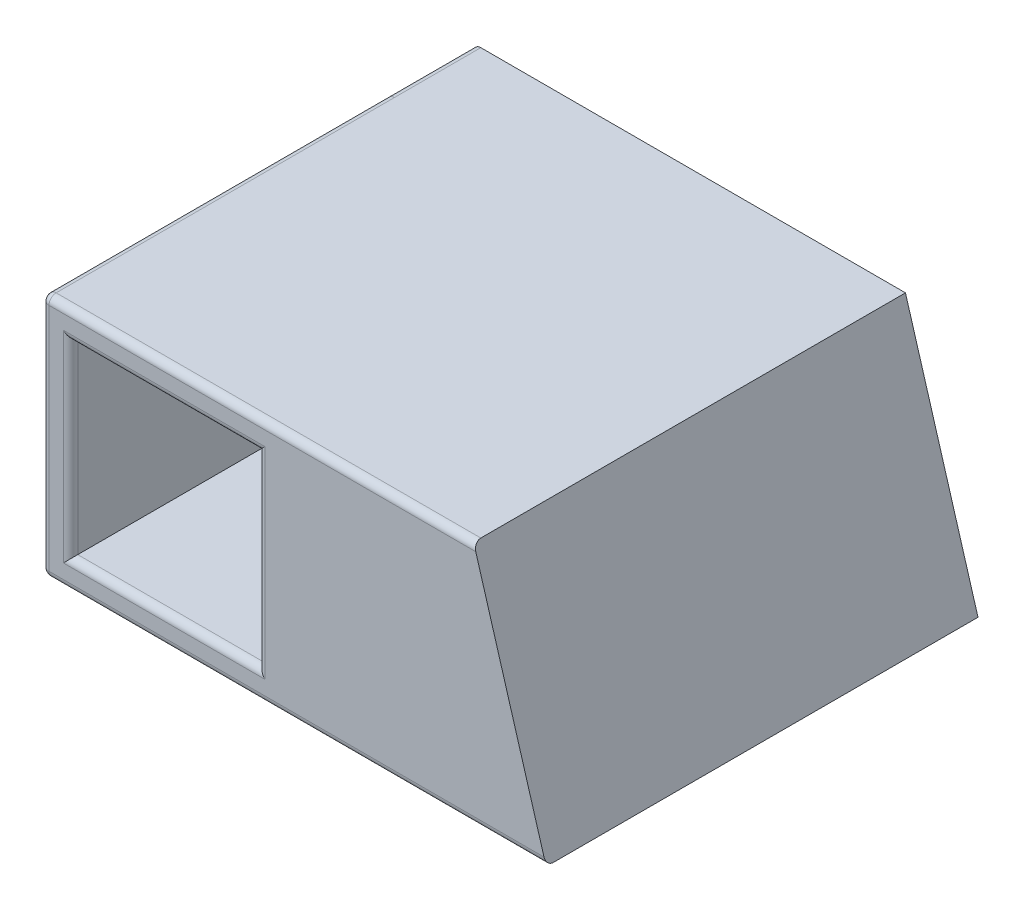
ISO-10303-21;
HEADER;
FILE_DESCRIPTION(('STEP AP214'),'2;1');
FILE_NAME('part.step','',(''),(''),'','','');
FILE_SCHEMA(('AUTOMOTIVE_DESIGN { 1 0 10303 214 1 1 1 1 }'));
ENDSEC;
DATA;
#1=APPLICATION_CONTEXT('core data for automotive mechanical design processes');
#2=APPLICATION_PROTOCOL_DEFINITION('international standard','automotive_design',2000,#1);
#3=PRODUCT_CONTEXT('',#1,'mechanical');
#4=PRODUCT('Part','Part','',(#3));
#5=PRODUCT_RELATED_PRODUCT_CATEGORY('part','',(#4));
#6=PRODUCT_DEFINITION_FORMATION('','',#4);
#7=PRODUCT_DEFINITION_CONTEXT('part definition',#1,'design');
#8=PRODUCT_DEFINITION('design','',#6,#7);
#9=PRODUCT_DEFINITION_SHAPE('','',#8);
#10=(LENGTH_UNIT() NAMED_UNIT(*) SI_UNIT(.MILLI.,.METRE.));
#11=(NAMED_UNIT(*) PLANE_ANGLE_UNIT() SI_UNIT($,.RADIAN.));
#12=(NAMED_UNIT(*) SI_UNIT($,.STERADIAN.) SOLID_ANGLE_UNIT());
#13=UNCERTAINTY_MEASURE_WITH_UNIT(LENGTH_MEASURE(1.E-05),#10,'distance_accuracy_value','');
#14=(GEOMETRIC_REPRESENTATION_CONTEXT(3) GLOBAL_UNCERTAINTY_ASSIGNED_CONTEXT((#13)) GLOBAL_UNIT_ASSIGNED_CONTEXT((#10,
#11,#12)) REPRESENTATION_CONTEXT('',''));
#15=CARTESIAN_POINT('',(0.,0.,0.));
#16=DIRECTION('',(0.,0.,1.));
#17=DIRECTION('',(1.,0.,0.));
#18=AXIS2_PLACEMENT_3D('',#15,#16,#17);
#19=CARTESIAN_POINT('',(0.508,3.81,6.35));
#20=DIRECTION('',(1.,0.,0.));
#21=DIRECTION('',(0.,1.,0.));
#22=AXIS2_PLACEMENT_3D('',#19,#20,#21);
#23=PLANE('',#22);
#24=DIRECTION('',(0.,0.,-1.));
#25=VECTOR('',#24,1.);
#26=CARTESIAN_POINT('',(0.508,0.507999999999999,6.35));
#27=LINE('',#26,#25);
#28=CARTESIAN_POINT('',(0.508,0.507999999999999,6.223));
#29=VERTEX_POINT('',#28);
#30=CARTESIAN_POINT('',(0.508,0.507999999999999,0.254));
#31=VERTEX_POINT('',#30);
#32=EDGE_CURVE('E192',#29,#31,#27,.T.);
#33=ORIENTED_EDGE('',*,*,#32,.T.);
#34=DIRECTION('',(0.,1.,0.));
#35=VECTOR('',#34,1.);
#36=CARTESIAN_POINT('',(0.508,3.81,0.254));
#37=LINE('',#36,#35);
#38=CARTESIAN_POINT('',(0.508,3.81,0.254));
#39=VERTEX_POINT('',#38);
#40=EDGE_CURVE('E178',#31,#39,#37,.T.);
#41=ORIENTED_EDGE('',*,*,#40,.T.);
#42=DIRECTION('',(0.,0.,-1.));
#43=VECTOR('',#42,1.);
#44=CARTESIAN_POINT('',(0.508,3.81,6.35));
#45=LINE('',#44,#43);
#46=CARTESIAN_POINT('',(0.508,3.81,6.223));
#47=VERTEX_POINT('',#46);
#48=EDGE_CURVE('E182',#47,#39,#45,.T.);
#49=ORIENTED_EDGE('',*,*,#48,.F.);
#50=DIRECTION('',(0.,-1.,0.));
#51=VECTOR('',#50,1.);
#52=CARTESIAN_POINT('',(0.508,0.507999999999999,6.223));
#53=LINE('',#52,#51);
#54=EDGE_CURVE('E210',#47,#29,#53,.T.);
#55=ORIENTED_EDGE('',*,*,#54,.T.);
#56=EDGE_LOOP('',(#33,#41,#49,#55));
#57=FACE_BOUND('',#56,.T.);
#58=ADVANCED_FACE('F32',(#57),#23,.T.);
#59=CARTESIAN_POINT('',(0.508,0.507999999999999,6.35));
#60=DIRECTION('',(0.,1.,0.));
#61=DIRECTION('',(0.,0.,1.));
#62=AXIS2_PLACEMENT_3D('',#59,#60,#61);
#63=PLANE('',#62);
#64=DIRECTION('',(0.,0.,-1.));
#65=VECTOR('',#64,1.);
#66=CARTESIAN_POINT('',(3.81,0.507999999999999,6.35));
#67=LINE('',#66,#65);
#68=CARTESIAN_POINT('',(3.81,0.507999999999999,6.223));
#69=VERTEX_POINT('',#68);
#70=CARTESIAN_POINT('',(3.81,0.507999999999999,0.254));
#71=VERTEX_POINT('',#70);
#72=EDGE_CURVE('E189',#69,#71,#67,.T.);
#73=ORIENTED_EDGE('',*,*,#72,.T.);
#74=DIRECTION('',(-1.,0.,0.));
#75=VECTOR('',#74,1.);
#76=CARTESIAN_POINT('',(0.508,0.507999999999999,0.254));
#77=LINE('',#76,#75);
#78=EDGE_CURVE('E175',#71,#31,#77,.T.);
#79=ORIENTED_EDGE('',*,*,#78,.T.);
#80=ORIENTED_EDGE('',*,*,#32,.F.);
#81=DIRECTION('',(1.,0.,0.));
#82=VECTOR('',#81,1.);
#83=CARTESIAN_POINT('',(3.81,0.507999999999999,6.223));
#84=LINE('',#83,#82);
#85=EDGE_CURVE('E198',#29,#69,#84,.T.);
#86=ORIENTED_EDGE('',*,*,#85,.T.);
#87=EDGE_LOOP('',(#73,#79,#80,#86));
#88=FACE_BOUND('',#87,.T.);
#89=ADVANCED_FACE('F330',(#88),#63,.T.);
#90=CARTESIAN_POINT('',(3.81,3.81,6.35));
#91=DIRECTION('',(-1.,0.,0.));
#92=DIRECTION('',(0.,-1.,0.));
#93=AXIS2_PLACEMENT_3D('',#90,#91,#92);
#94=PLANE('',#93);
#95=DIRECTION('',(0.,0.,-1.));
#96=VECTOR('',#95,1.);
#97=CARTESIAN_POINT('',(3.81,3.81,6.35));
#98=LINE('',#97,#96);
#99=CARTESIAN_POINT('',(3.81,3.81,6.223));
#100=VERTEX_POINT('',#99);
#101=CARTESIAN_POINT('',(3.81,3.81,0.254));
#102=VERTEX_POINT('',#101);
#103=EDGE_CURVE('E185',#100,#102,#98,.T.);
#104=ORIENTED_EDGE('',*,*,#103,.T.);
#105=DIRECTION('',(0.,-1.,0.));
#106=VECTOR('',#105,1.);
#107=CARTESIAN_POINT('',(3.81,3.81,0.254));
#108=LINE('',#107,#106);
#109=EDGE_CURVE('E172',#102,#71,#108,.T.);
#110=ORIENTED_EDGE('',*,*,#109,.T.);
#111=ORIENTED_EDGE('',*,*,#72,.F.);
#112=DIRECTION('',(0.,1.,0.));
#113=VECTOR('',#112,1.);
#114=CARTESIAN_POINT('',(3.81,3.81,6.223));
#115=LINE('',#114,#113);
#116=EDGE_CURVE('E214',#69,#100,#115,.T.);
#117=ORIENTED_EDGE('',*,*,#116,.T.);
#118=EDGE_LOOP('',(#104,#110,#111,#117));
#119=FACE_BOUND('',#118,.T.);
#120=ADVANCED_FACE('F336',(#119),#94,.T.);
#121=CARTESIAN_POINT('',(0.508,3.81,6.35));
#122=DIRECTION('',(0.,-1.,0.));
#123=DIRECTION('',(0.,0.,-1.));
#124=AXIS2_PLACEMENT_3D('',#121,#122,#123);
#125=PLANE('',#124);
#126=ORIENTED_EDGE('',*,*,#48,.T.);
#127=DIRECTION('',(1.,0.,0.));
#128=VECTOR('',#127,1.);
#129=CARTESIAN_POINT('',(0.508,3.81,0.254));
#130=LINE('',#129,#128);
#131=EDGE_CURVE('E166',#39,#102,#130,.T.);
#132=ORIENTED_EDGE('',*,*,#131,.T.);
#133=ORIENTED_EDGE('',*,*,#103,.F.);
#134=DIRECTION('',(-1.,0.,0.));
#135=VECTOR('',#134,1.);
#136=CARTESIAN_POINT('',(0.508,3.81,6.223));
#137=LINE('',#136,#135);
#138=EDGE_CURVE('E212',#100,#47,#137,.T.);
#139=ORIENTED_EDGE('',*,*,#138,.T.);
#140=EDGE_LOOP('',(#126,#132,#133,#139));
#141=FACE_BOUND('',#140,.T.);
#142=ADVANCED_FACE('F374',(#141),#125,.T.);
#143=CARTESIAN_POINT('',(0.127,4.191,6.35));
#144=DIRECTION('',(0.,0.,-1.));
#145=DIRECTION('',(-1.,0.,0.));
#146=AXIS2_PLACEMENT_3D('',#143,#144,#145);
#147=CYLINDRICAL_SURFACE('',#146,0.127);
#148=DIRECTION('',(0.,0.,-1.));
#149=VECTOR('',#148,1.);
#150=CARTESIAN_POINT('',(0.127,4.318,6.35));
#151=LINE('',#150,#149);
#152=CARTESIAN_POINT('',(0.127,4.318,0.254));
#153=VERTEX_POINT('',#152);
#154=CARTESIAN_POINT('',(0.127,4.318,6.223));
#155=VERTEX_POINT('',#154);
#156=EDGE_CURVE('E241',#153,#155,#151,.F.);
#157=ORIENTED_EDGE('',*,*,#156,.F.);
#158=CARTESIAN_POINT('',(0.127,4.191,0.254));
#159=DIRECTION('',(0.,0.,-1.));
#160=DIRECTION('',(-1.,0.,0.));
#161=AXIS2_PLACEMENT_3D('',#158,#159,#160);
#162=CIRCLE('',#161,0.127);
#163=CARTESIAN_POINT('',(0.,4.191,0.254));
#164=VERTEX_POINT('',#163);
#165=EDGE_CURVE('E164',#153,#164,#162,.F.);
#166=ORIENTED_EDGE('',*,*,#165,.T.);
#167=DIRECTION('',(0.,0.,-1.));
#168=VECTOR('',#167,1.);
#169=CARTESIAN_POINT('',(0.,4.191,6.35));
#170=LINE('',#169,#168);
#171=CARTESIAN_POINT('',(0.,4.191,6.223));
#172=VERTEX_POINT('',#171);
#173=EDGE_CURVE('E244',#172,#164,#170,.T.);
#174=ORIENTED_EDGE('',*,*,#173,.F.);
#175=CARTESIAN_POINT('',(0.127,4.191,6.223));
#176=DIRECTION('',(0.,0.,1.));
#177=DIRECTION('',(1.,0.,0.));
#178=AXIS2_PLACEMENT_3D('',#175,#176,#177);
#179=CIRCLE('',#178,0.127);
#180=EDGE_CURVE('E263',#172,#155,#179,.F.);
#181=ORIENTED_EDGE('',*,*,#180,.T.);
#182=EDGE_LOOP('',(#157,#166,#174,#181));
#183=FACE_BOUND('',#182,.T.);
#184=ADVANCED_FACE('F312',(#183),#147,.T.);
#185=CARTESIAN_POINT('',(0.127,0.127,6.35));
#186=DIRECTION('',(0.,0.,-1.));
#187=DIRECTION('',(-1.,0.,0.));
#188=AXIS2_PLACEMENT_3D('',#185,#186,#187);
#189=CYLINDRICAL_SURFACE('',#188,0.127);
#190=DIRECTION('',(0.,0.,-1.));
#191=VECTOR('',#190,1.);
#192=CARTESIAN_POINT('',(0.,0.127,6.35));
#193=LINE('',#192,#191);
#194=CARTESIAN_POINT('',(0.,0.127,0.254));
#195=VERTEX_POINT('',#194);
#196=CARTESIAN_POINT('',(0.,0.127,6.223));
#197=VERTEX_POINT('',#196);
#198=EDGE_CURVE('E249',#195,#197,#193,.F.);
#199=ORIENTED_EDGE('',*,*,#198,.F.);
#200=CARTESIAN_POINT('',(0.127,0.127,0.254));
#201=DIRECTION('',(0.,0.,-1.));
#202=DIRECTION('',(-1.,0.,0.));
#203=AXIS2_PLACEMENT_3D('',#200,#201,#202);
#204=CIRCLE('',#203,0.127);
#205=CARTESIAN_POINT('',(0.127,0.,0.254));
#206=VERTEX_POINT('',#205);
#207=EDGE_CURVE('E251',#195,#206,#204,.F.);
#208=ORIENTED_EDGE('',*,*,#207,.T.);
#209=DIRECTION('',(0.,0.,-1.));
#210=VECTOR('',#209,1.);
#211=CARTESIAN_POINT('',(0.127,0.,6.35));
#212=LINE('',#211,#210);
#213=CARTESIAN_POINT('',(0.127,0.,6.223));
#214=VERTEX_POINT('',#213);
#215=EDGE_CURVE('E216',#214,#206,#212,.T.);
#216=ORIENTED_EDGE('',*,*,#215,.F.);
#217=CARTESIAN_POINT('',(0.127,0.127,6.223));
#218=DIRECTION('',(0.,0.,1.));
#219=DIRECTION('',(1.,0.,0.));
#220=AXIS2_PLACEMENT_3D('',#217,#218,#219);
#221=CIRCLE('',#220,0.127);
#222=EDGE_CURVE('E181',#214,#197,#221,.F.);
#223=ORIENTED_EDGE('',*,*,#222,.T.);
#224=EDGE_LOOP('',(#199,#208,#216,#223));
#225=FACE_BOUND('',#224,.T.);
#226=ADVANCED_FACE('F285',(#225),#189,.T.);
#227=CARTESIAN_POINT('',(0.,0.,6.35));
#228=DIRECTION('',(0.,0.,-1.));
#229=DIRECTION('',(-1.,0.,0.));
#230=AXIS2_PLACEMENT_3D('',#227,#228,#229);
#231=PLANE('',#230);
#232=DIRECTION('',(0.,1.,0.));
#233=VECTOR('',#232,1.);
#234=CARTESIAN_POINT('',(3.937,0.507999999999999,6.35));
#235=LINE('',#234,#233);
#236=CARTESIAN_POINT('',(3.937,3.937,6.35));
#237=VERTEX_POINT('',#236);
#238=CARTESIAN_POINT('',(3.937,0.380999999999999,6.35));
#239=VERTEX_POINT('',#238);
#240=EDGE_CURVE('E201',#237,#239,#235,.F.);
#241=ORIENTED_EDGE('',*,*,#240,.T.);
#242=DIRECTION('',(1.,0.,0.));
#243=VECTOR('',#242,1.);
#244=CARTESIAN_POINT('',(0.508,0.380999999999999,6.35));
#245=LINE('',#244,#243);
#246=CARTESIAN_POINT('',(0.381,0.380999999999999,6.35));
#247=VERTEX_POINT('',#246);
#248=EDGE_CURVE('E207',#239,#247,#245,.F.);
#249=ORIENTED_EDGE('',*,*,#248,.T.);
#250=DIRECTION('',(0.,-1.,0.));
#251=VECTOR('',#250,1.);
#252=CARTESIAN_POINT('',(0.381,3.81,6.35));
#253=LINE('',#252,#251);
#254=CARTESIAN_POINT('',(0.381,3.937,6.35));
#255=VERTEX_POINT('',#254);
#256=EDGE_CURVE('E205',#247,#255,#253,.F.);
#257=ORIENTED_EDGE('',*,*,#256,.T.);
#258=DIRECTION('',(-1.,0.,0.));
#259=VECTOR('',#258,1.);
#260=CARTESIAN_POINT('',(3.81,3.937,6.35));
#261=LINE('',#260,#259);
#262=EDGE_CURVE('E203',#255,#237,#261,.F.);
#263=ORIENTED_EDGE('',*,*,#262,.T.);
#264=EDGE_LOOP('',(#241,#249,#257,#263));
#265=FACE_BOUND('',#264,.T.);
#266=DIRECTION('',(0.,-1.,0.));
#267=VECTOR('',#266,1.);
#268=CARTESIAN_POINT('',(0.127,0.,6.35));
#269=LINE('',#268,#267);
#270=CARTESIAN_POINT('',(0.127,4.191,6.35));
#271=VERTEX_POINT('',#270);
#272=CARTESIAN_POINT('',(0.127,0.127,6.35));
#273=VERTEX_POINT('',#272);
#274=EDGE_CURVE('E235',#271,#273,#269,.T.);
#275=ORIENTED_EDGE('',*,*,#274,.T.);
#276=DIRECTION('',(1.,0.,0.));
#277=VECTOR('',#276,1.);
#278=CARTESIAN_POINT('',(0.,0.127,6.35));
#279=LINE('',#278,#277);
#280=CARTESIAN_POINT('',(8.8622264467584,0.127,6.35));
#281=VERTEX_POINT('',#280);
#282=EDGE_CURVE('E239',#273,#281,#279,.T.);
#283=ORIENTED_EDGE('',*,*,#282,.T.);
#284=DIRECTION('',(-0.284182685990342,0.958770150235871,0.));
#285=VECTOR('',#284,1.);
#286=CARTESIAN_POINT('',(7.62,4.318,6.35));
#287=LINE('',#286,#285);
#288=CARTESIAN_POINT('',(7.65764322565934,4.191,6.35));
#289=VERTEX_POINT('',#288);
#290=EDGE_CURVE('E160',#281,#289,#287,.T.);
#291=ORIENTED_EDGE('',*,*,#290,.T.);
#292=DIRECTION('',(-1.,0.,0.));
#293=VECTOR('',#292,1.);
#294=CARTESIAN_POINT('',(0.,4.191,6.35));
#295=LINE('',#294,#293);
#296=EDGE_CURVE('E237',#289,#271,#295,.T.);
#297=ORIENTED_EDGE('',*,*,#296,.T.);
#298=EDGE_LOOP('',(#275,#283,#291,#297));
#299=FACE_BOUND('',#298,.T.);
#300=ADVANCED_FACE('F341',(#265,#299),#231,.F.);
#301=CARTESIAN_POINT('',(8.89986967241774,0.,6.35));
#302=DIRECTION('',(0.,1.,0.));
#303=DIRECTION('',(-1.,0.,0.));
#304=AXIS2_PLACEMENT_3D('',#301,#302,#303);
#305=PLANE('',#304);
#306=ORIENTED_EDGE('',*,*,#215,.T.);
#307=DIRECTION('',(0.,0.,-1.));
#308=VECTOR('',#307,1.);
#309=CARTESIAN_POINT('',(0.127,0.,6.35));
#310=LINE('',#309,#308);
#311=CARTESIAN_POINT('',(0.127,0.,-1.27));
#312=VERTEX_POINT('',#311);
#313=EDGE_CURVE('E269',#206,#312,#310,.T.);
#314=ORIENTED_EDGE('',*,*,#313,.T.);
#315=DIRECTION('',(-1.,0.,0.));
#316=VECTOR('',#315,1.);
#317=CARTESIAN_POINT('',(0.,0.,-1.27));
#318=LINE('',#317,#316);
#319=CARTESIAN_POINT('',(8.89986967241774,0.,-1.27));
#320=VERTEX_POINT('',#319);
#321=EDGE_CURVE('E292',#320,#312,#318,.T.);
#322=ORIENTED_EDGE('',*,*,#321,.F.);
#323=DIRECTION('',(0.,0.,-1.));
#324=VECTOR('',#323,1.);
#325=CARTESIAN_POINT('',(8.89986967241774,0.,6.35));
#326=LINE('',#325,#324);
#327=CARTESIAN_POINT('',(8.89986967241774,0.,6.223));
#328=VERTEX_POINT('',#327);
#329=EDGE_CURVE('E159',#328,#320,#326,.T.);
#330=ORIENTED_EDGE('',*,*,#329,.F.);
#331=DIRECTION('',(1.,0.,0.));
#332=VECTOR('',#331,1.);
#333=CARTESIAN_POINT('',(8.89986967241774,0.,6.223));
#334=LINE('',#333,#332);
#335=EDGE_CURVE('E229',#328,#214,#334,.F.);
#336=ORIENTED_EDGE('',*,*,#335,.T.);
#337=EDGE_LOOP('',(#306,#314,#322,#330,#336));
#338=FACE_BOUND('',#337,.T.);
#339=ADVANCED_FACE('F291',(#338),#305,.F.);
#340=CARTESIAN_POINT('',(7.62,4.318,6.35));
#341=DIRECTION('',(-0.958770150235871,-0.284182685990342,0.));
#342=DIRECTION('',(0.284182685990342,-0.958770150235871,0.));
#343=AXIS2_PLACEMENT_3D('',#340,#341,#342);
#344=PLANE('',#343);
#345=DIRECTION('',(0.284182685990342,-0.958770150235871,0.));
#346=VECTOR('',#345,1.);
#347=CARTESIAN_POINT('',(8.89986967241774,0.,-1.27));
#348=LINE('',#347,#346);
#349=CARTESIAN_POINT('',(7.62,4.318,-1.27));
#350=VERTEX_POINT('',#349);
#351=EDGE_CURVE('E147',#350,#320,#348,.T.);
#352=ORIENTED_EDGE('',*,*,#351,.F.);
#353=DIRECTION('',(0.,0.,-1.));
#354=VECTOR('',#353,1.);
#355=CARTESIAN_POINT('',(7.62,4.318,6.35));
#356=LINE('',#355,#354);
#357=CARTESIAN_POINT('',(7.62,4.318,6.223));
#358=VERTEX_POINT('',#357);
#359=EDGE_CURVE('E153',#358,#350,#356,.T.);
#360=ORIENTED_EDGE('',*,*,#359,.F.);
#361=CARTESIAN_POINT('',(7.65764322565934,4.191,6.223));
#362=DIRECTION('',(-0.958770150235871,-0.284182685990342,0.));
#363=DIRECTION('',(-0.284182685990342,0.958770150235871,0.));
#364=AXIS2_PLACEMENT_3D('',#361,#362,#363);
#365=ELLIPSE('',#364,0.132461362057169,0.127);
#366=EDGE_CURVE('E231',#358,#289,#365,.F.);
#367=ORIENTED_EDGE('',*,*,#366,.T.);
#368=ORIENTED_EDGE('',*,*,#290,.F.);
#369=CARTESIAN_POINT('',(8.8622264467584,0.127,6.223));
#370=DIRECTION('',(-0.958770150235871,-0.284182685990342,0.));
#371=DIRECTION('',(0.284182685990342,-0.958770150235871,0.));
#372=AXIS2_PLACEMENT_3D('',#369,#370,#371);
#373=ELLIPSE('',#372,0.132461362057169,0.127);
#374=EDGE_CURVE('E233',#281,#328,#373,.F.);
#375=ORIENTED_EDGE('',*,*,#374,.T.);
#376=ORIENTED_EDGE('',*,*,#329,.T.);
#377=EDGE_LOOP('',(#352,#360,#367,#368,#375,#376));
#378=FACE_BOUND('',#377,.T.);
#379=ADVANCED_FACE('F162',(#378),#344,.F.);
#380=CARTESIAN_POINT('',(0.,4.318,6.35));
#381=DIRECTION('',(0.,-1.,0.));
#382=DIRECTION('',(0.,0.,-1.));
#383=AXIS2_PLACEMENT_3D('',#380,#381,#382);
#384=PLANE('',#383);
#385=DIRECTION('',(1.,0.,0.));
#386=VECTOR('',#385,1.);
#387=CARTESIAN_POINT('',(7.62,4.318,-1.27));
#388=LINE('',#387,#386);
#389=CARTESIAN_POINT('',(0.127000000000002,4.318,-1.27));
#390=VERTEX_POINT('',#389);
#391=EDGE_CURVE('E142',#390,#350,#388,.T.);
#392=ORIENTED_EDGE('',*,*,#391,.F.);
#393=DIRECTION('',(0.,0.,-1.));
#394=VECTOR('',#393,1.);
#395=CARTESIAN_POINT('',(0.127,4.318,6.35));
#396=LINE('',#395,#394);
#397=EDGE_CURVE('E11',#390,#153,#396,.F.);
#398=ORIENTED_EDGE('',*,*,#397,.T.);
#399=ORIENTED_EDGE('',*,*,#156,.T.);
#400=DIRECTION('',(-1.,0.,0.));
#401=VECTOR('',#400,1.);
#402=CARTESIAN_POINT('',(0.,4.318,6.223));
#403=LINE('',#402,#401);
#404=EDGE_CURVE('E156',#155,#358,#403,.F.);
#405=ORIENTED_EDGE('',*,*,#404,.T.);
#406=ORIENTED_EDGE('',*,*,#359,.T.);
#407=EDGE_LOOP('',(#392,#398,#399,#405,#406));
#408=FACE_BOUND('',#407,.T.);
#409=ADVANCED_FACE('F154',(#408),#384,.F.);
#410=CARTESIAN_POINT('',(0.,0.,6.35));
#411=DIRECTION('',(1.,0.,0.));
#412=DIRECTION('',(0.,0.,-1.));
#413=AXIS2_PLACEMENT_3D('',#410,#411,#412);
#414=PLANE('',#413);
#415=DIRECTION('',(0.,1.,0.));
#416=VECTOR('',#415,1.);
#417=CARTESIAN_POINT('',(0.,4.318,-1.27));
#418=LINE('',#417,#416);
#419=CARTESIAN_POINT('',(0.,0.127,-1.27));
#420=VERTEX_POINT('',#419);
#421=CARTESIAN_POINT('',(0.,4.191,-1.27));
#422=VERTEX_POINT('',#421);
#423=EDGE_CURVE('E150',#420,#422,#418,.T.);
#424=ORIENTED_EDGE('',*,*,#423,.F.);
#425=DIRECTION('',(0.,0.,-1.));
#426=VECTOR('',#425,1.);
#427=CARTESIAN_POINT('',(0.,0.127,6.35));
#428=LINE('',#427,#426);
#429=EDGE_CURVE('E40',#420,#195,#428,.F.);
#430=ORIENTED_EDGE('',*,*,#429,.T.);
#431=ORIENTED_EDGE('',*,*,#198,.T.);
#432=DIRECTION('',(0.,-1.,0.));
#433=VECTOR('',#432,1.);
#434=CARTESIAN_POINT('',(0.,0.,6.223));
#435=LINE('',#434,#433);
#436=EDGE_CURVE('E247',#197,#172,#435,.F.);
#437=ORIENTED_EDGE('',*,*,#436,.T.);
#438=ORIENTED_EDGE('',*,*,#173,.T.);
#439=DIRECTION('',(0.,0.,-1.));
#440=VECTOR('',#439,1.);
#441=CARTESIAN_POINT('',(0.,4.191,6.35));
#442=LINE('',#441,#440);
#443=EDGE_CURVE('E275',#164,#422,#442,.T.);
#444=ORIENTED_EDGE('',*,*,#443,.T.);
#445=EDGE_LOOP('',(#424,#430,#431,#437,#438,#444));
#446=FACE_BOUND('',#445,.T.);
#447=ADVANCED_FACE('F280',(#446),#414,.F.);
#448=CARTESIAN_POINT('',(0.508,3.937,6.223));
#449=DIRECTION('',(1.,0.,0.));
#450=DIRECTION('',(0.,0.,-1.));
#451=AXIS2_PLACEMENT_3D('',#448,#449,#450);
#452=CYLINDRICAL_SURFACE('',#451,0.127);
#453=CARTESIAN_POINT('',(3.937,3.937,6.223));
#454=DIRECTION('',(0.707106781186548,-0.707106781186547,0.));
#455=DIRECTION('',(0.707106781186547,0.707106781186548,0.));
#456=AXIS2_PLACEMENT_3D('',#453,#454,#455);
#457=ELLIPSE('',#456,0.179605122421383,0.127);
#458=EDGE_CURVE('E222',#237,#100,#457,.T.);
#459=ORIENTED_EDGE('',*,*,#458,.F.);
#460=ORIENTED_EDGE('',*,*,#262,.F.);
#461=CARTESIAN_POINT('',(0.381,3.937,6.223));
#462=DIRECTION('',(0.707106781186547,0.707106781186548,0.));
#463=DIRECTION('',(-0.707106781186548,0.707106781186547,0.));
#464=AXIS2_PLACEMENT_3D('',#461,#462,#463);
#465=ELLIPSE('',#464,0.179605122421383,0.127);
#466=EDGE_CURVE('E186',#47,#255,#465,.F.);
#467=ORIENTED_EDGE('',*,*,#466,.F.);
#468=ORIENTED_EDGE('',*,*,#138,.F.);
#469=EDGE_LOOP('',(#459,#460,#467,#468));
#470=FACE_BOUND('',#469,.T.);
#471=ADVANCED_FACE('F347',(#470),#452,.T.);
#472=CARTESIAN_POINT('',(0.381,3.81,6.223));
#473=DIRECTION('',(0.,1.,0.));
#474=DIRECTION('',(-1.,0.,0.));
#475=AXIS2_PLACEMENT_3D('',#472,#473,#474);
#476=CYLINDRICAL_SURFACE('',#475,0.127);
#477=ORIENTED_EDGE('',*,*,#466,.T.);
#478=ORIENTED_EDGE('',*,*,#256,.F.);
#479=CARTESIAN_POINT('',(0.381000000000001,0.380999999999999,6.223));
#480=DIRECTION('',(-0.707106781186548,0.707106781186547,0.));
#481=DIRECTION('',(-0.707106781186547,-0.707106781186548,0.));
#482=AXIS2_PLACEMENT_3D('',#479,#480,#481);
#483=ELLIPSE('',#482,0.179605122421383,0.127);
#484=EDGE_CURVE('E219',#29,#247,#483,.F.);
#485=ORIENTED_EDGE('',*,*,#484,.F.);
#486=ORIENTED_EDGE('',*,*,#54,.F.);
#487=EDGE_LOOP('',(#477,#478,#485,#486));
#488=FACE_BOUND('',#487,.T.);
#489=ADVANCED_FACE('F360',(#488),#476,.T.);
#490=CARTESIAN_POINT('',(3.937,3.81,6.223));
#491=DIRECTION('',(0.,-1.,0.));
#492=DIRECTION('',(1.,0.,0.));
#493=AXIS2_PLACEMENT_3D('',#490,#491,#492);
#494=CYLINDRICAL_SURFACE('',#493,0.127);
#495=ORIENTED_EDGE('',*,*,#458,.T.);
#496=ORIENTED_EDGE('',*,*,#116,.F.);
#497=CARTESIAN_POINT('',(3.937,0.380999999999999,6.223));
#498=DIRECTION('',(-0.707106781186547,-0.707106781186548,0.));
#499=DIRECTION('',(-0.707106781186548,0.707106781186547,0.));
#500=AXIS2_PLACEMENT_3D('',#497,#498,#499);
#501=ELLIPSE('',#500,0.179605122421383,0.127);
#502=EDGE_CURVE('E217',#239,#69,#501,.T.);
#503=ORIENTED_EDGE('',*,*,#502,.F.);
#504=ORIENTED_EDGE('',*,*,#240,.F.);
#505=EDGE_LOOP('',(#495,#496,#503,#504));
#506=FACE_BOUND('',#505,.T.);
#507=ADVANCED_FACE('F356',(#506),#494,.T.);
#508=CARTESIAN_POINT('',(0.508,0.380999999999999,6.223));
#509=DIRECTION('',(-1.,0.,0.));
#510=DIRECTION('',(0.,0.,1.));
#511=AXIS2_PLACEMENT_3D('',#508,#509,#510);
#512=CYLINDRICAL_SURFACE('',#511,0.127);
#513=ORIENTED_EDGE('',*,*,#484,.T.);
#514=ORIENTED_EDGE('',*,*,#248,.F.);
#515=ORIENTED_EDGE('',*,*,#502,.T.);
#516=ORIENTED_EDGE('',*,*,#85,.F.);
#517=EDGE_LOOP('',(#513,#514,#515,#516));
#518=FACE_BOUND('',#517,.T.);
#519=ADVANCED_FACE('F326',(#518),#512,.T.);
#520=CARTESIAN_POINT('',(0.,4.191,6.223));
#521=DIRECTION('',(-1.,0.,0.));
#522=DIRECTION('',(0.,0.,1.));
#523=AXIS2_PLACEMENT_3D('',#520,#521,#522);
#524=CYLINDRICAL_SURFACE('',#523,0.127);
#525=CARTESIAN_POINT('',(0.127,4.191,6.223));
#526=DIRECTION('',(-1.,0.,0.));
#527=DIRECTION('',(0.,0.,1.));
#528=AXIS2_PLACEMENT_3D('',#525,#526,#527);
#529=CIRCLE('',#528,0.127);
#530=EDGE_CURVE('E220',#271,#155,#529,.T.);
#531=ORIENTED_EDGE('',*,*,#530,.F.);
#532=ORIENTED_EDGE('',*,*,#296,.F.);
#533=ORIENTED_EDGE('',*,*,#366,.F.);
#534=ORIENTED_EDGE('',*,*,#404,.F.);
#535=EDGE_LOOP('',(#531,#532,#533,#534));
#536=FACE_BOUND('',#535,.T.);
#537=ADVANCED_FACE('F315',(#536),#524,.T.);
#538=CARTESIAN_POINT('',(0.127,4.191,6.223));
#539=DIRECTION('',(0.,0.,1.));
#540=DIRECTION('',(1.,0.,0.));
#541=AXIS2_PLACEMENT_3D('',#538,#539,#540);
#542=SPHERICAL_SURFACE('',#541,0.127);
#543=CARTESIAN_POINT('',(0.127,4.191,6.223));
#544=DIRECTION('',(0.,1.,0.));
#545=DIRECTION('',(0.,0.,1.));
#546=AXIS2_PLACEMENT_3D('',#543,#544,#545);
#547=CIRCLE('',#546,0.127);
#548=EDGE_CURVE('E260',#271,#172,#547,.F.);
#549=ORIENTED_EDGE('',*,*,#548,.F.);
#550=ORIENTED_EDGE('',*,*,#530,.T.);
#551=ORIENTED_EDGE('',*,*,#180,.F.);
#552=EDGE_LOOP('',(#549,#550,#551));
#553=FACE_BOUND('',#552,.T.);
#554=ADVANCED_FACE('F318',(#553),#542,.T.);
#555=CARTESIAN_POINT('',(0.127,0.,6.223));
#556=DIRECTION('',(0.,-1.,0.));
#557=DIRECTION('',(0.,0.,-1.));
#558=AXIS2_PLACEMENT_3D('',#555,#556,#557);
#559=CYLINDRICAL_SURFACE('',#558,0.127);
#560=ORIENTED_EDGE('',*,*,#548,.T.);
#561=ORIENTED_EDGE('',*,*,#436,.F.);
#562=CARTESIAN_POINT('',(0.127,0.127,6.223));
#563=DIRECTION('',(0.,-1.,0.));
#564=DIRECTION('',(0.,0.,-1.));
#565=AXIS2_PLACEMENT_3D('',#562,#563,#564);
#566=CIRCLE('',#565,0.127);
#567=EDGE_CURVE('E257',#273,#197,#566,.T.);
#568=ORIENTED_EDGE('',*,*,#567,.F.);
#569=ORIENTED_EDGE('',*,*,#274,.F.);
#570=EDGE_LOOP('',(#560,#561,#568,#569));
#571=FACE_BOUND('',#570,.T.);
#572=ADVANCED_FACE('F305',(#571),#559,.T.);
#573=CARTESIAN_POINT('',(0.,0.127,6.223));
#574=DIRECTION('',(1.,0.,0.));
#575=DIRECTION('',(0.,1.,0.));
#576=AXIS2_PLACEMENT_3D('',#573,#574,#575);
#577=CYLINDRICAL_SURFACE('',#576,0.127);
#578=ORIENTED_EDGE('',*,*,#374,.F.);
#579=ORIENTED_EDGE('',*,*,#282,.F.);
#580=CARTESIAN_POINT('',(0.127,0.127,6.223));
#581=DIRECTION('',(-1.,0.,0.));
#582=DIRECTION('',(0.,0.,1.));
#583=AXIS2_PLACEMENT_3D('',#580,#581,#582);
#584=CIRCLE('',#583,0.127);
#585=EDGE_CURVE('E254',#214,#273,#584,.T.);
#586=ORIENTED_EDGE('',*,*,#585,.F.);
#587=ORIENTED_EDGE('',*,*,#335,.F.);
#588=EDGE_LOOP('',(#578,#579,#586,#587));
#589=FACE_BOUND('',#588,.T.);
#590=ADVANCED_FACE('F299',(#589),#577,.T.);
#591=CARTESIAN_POINT('',(0.127,0.127,6.223));
#592=DIRECTION('',(0.,0.,1.));
#593=DIRECTION('',(1.,0.,0.));
#594=AXIS2_PLACEMENT_3D('',#591,#592,#593);
#595=SPHERICAL_SURFACE('',#594,0.127);
#596=ORIENTED_EDGE('',*,*,#585,.T.);
#597=ORIENTED_EDGE('',*,*,#567,.T.);
#598=ORIENTED_EDGE('',*,*,#222,.F.);
#599=EDGE_LOOP('',(#596,#597,#598));
#600=FACE_BOUND('',#599,.T.);
#601=ADVANCED_FACE('F302',(#600),#595,.T.);
#602=CARTESIAN_POINT('',(0.,0.,-1.27));
#603=DIRECTION('',(0.,0.,-1.));
#604=DIRECTION('',(-1.,0.,0.));
#605=AXIS2_PLACEMENT_3D('',#602,#603,#604);
#606=PLANE('',#605);
#607=ORIENTED_EDGE('',*,*,#321,.T.);
#608=CARTESIAN_POINT('',(0.127,0.127,-1.27));
#609=DIRECTION('',(0.,0.,-1.));
#610=DIRECTION('',(-1.,0.,0.));
#611=AXIS2_PLACEMENT_3D('',#608,#609,#610);
#612=CIRCLE('',#611,0.127);
#613=EDGE_CURVE('E273',#312,#420,#612,.T.);
#614=ORIENTED_EDGE('',*,*,#613,.T.);
#615=ORIENTED_EDGE('',*,*,#423,.T.);
#616=CARTESIAN_POINT('',(0.127,4.191,-1.27));
#617=DIRECTION('',(0.,0.,-1.));
#618=DIRECTION('',(-1.,0.,0.));
#619=AXIS2_PLACEMENT_3D('',#616,#617,#618);
#620=CIRCLE('',#619,0.127);
#621=EDGE_CURVE('E47',#422,#390,#620,.T.);
#622=ORIENTED_EDGE('',*,*,#621,.T.);
#623=ORIENTED_EDGE('',*,*,#391,.T.);
#624=ORIENTED_EDGE('',*,*,#351,.T.);
#625=EDGE_LOOP('',(#607,#614,#615,#622,#623,#624));
#626=FACE_BOUND('',#625,.T.);
#627=ADVANCED_FACE('F145',(#626),#606,.T.);
#628=CARTESIAN_POINT('',(0.,0.,0.254));
#629=DIRECTION('',(0.,0.,-1.));
#630=DIRECTION('',(-1.,0.,0.));
#631=AXIS2_PLACEMENT_3D('',#628,#629,#630);
#632=PLANE('',#631);
#633=ORIENTED_EDGE('',*,*,#40,.F.);
#634=ORIENTED_EDGE('',*,*,#78,.F.);
#635=ORIENTED_EDGE('',*,*,#109,.F.);
#636=ORIENTED_EDGE('',*,*,#131,.F.);
#637=EDGE_LOOP('',(#633,#634,#635,#636));
#638=FACE_BOUND('',#637,.T.);
#639=ADVANCED_FACE('F385',(#638),#632,.F.);
#640=CARTESIAN_POINT('',(0.127,0.127,6.35));
#641=DIRECTION('',(0.,0.,-1.));
#642=DIRECTION('',(-1.,0.,0.));
#643=AXIS2_PLACEMENT_3D('',#640,#641,#642);
#644=CYLINDRICAL_SURFACE('',#643,0.127);
#645=ORIENTED_EDGE('',*,*,#207,.F.);
#646=ORIENTED_EDGE('',*,*,#429,.F.);
#647=ORIENTED_EDGE('',*,*,#613,.F.);
#648=ORIENTED_EDGE('',*,*,#313,.F.);
#649=EDGE_LOOP('',(#645,#646,#647,#648));
#650=FACE_BOUND('',#649,.T.);
#651=ADVANCED_FACE('F289',(#650),#644,.T.);
#652=CARTESIAN_POINT('',(0.127,4.191,6.35));
#653=DIRECTION('',(0.,0.,-1.));
#654=DIRECTION('',(-1.,0.,0.));
#655=AXIS2_PLACEMENT_3D('',#652,#653,#654);
#656=CYLINDRICAL_SURFACE('',#655,0.127);
#657=ORIENTED_EDGE('',*,*,#165,.F.);
#658=ORIENTED_EDGE('',*,*,#397,.F.);
#659=ORIENTED_EDGE('',*,*,#621,.F.);
#660=ORIENTED_EDGE('',*,*,#443,.F.);
#661=EDGE_LOOP('',(#657,#658,#659,#660));
#662=FACE_BOUND('',#661,.T.);
#663=ADVANCED_FACE('F34',(#662),#656,.T.);
#664=CLOSED_SHELL('',(#58,#89,#120,#142,#184,#226,#300,#339,#379,#409,#447,#471,#489,#507,#519,
#537,#554,#572,#590,#601,#627,#639,#651,#663));
#665=MANIFOLD_SOLID_BREP('B2',#664);
#666=ADVANCED_BREP_SHAPE_REPRESENTATION('',(#18,#665),#14);
#667=SHAPE_DEFINITION_REPRESENTATION(#9,#666);
ENDSEC;
END-ISO-10303-21;
